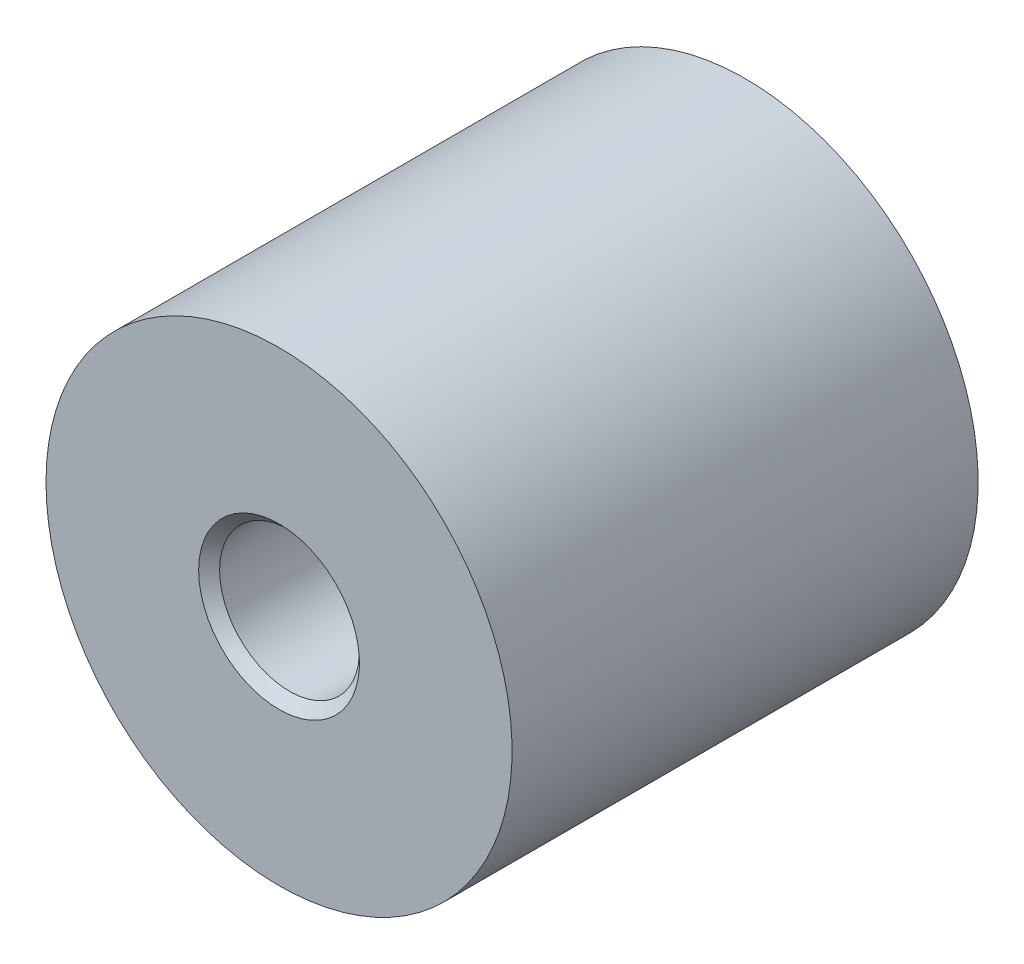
ISO-10303-21;
HEADER;
FILE_DESCRIPTION(('STEP AP214'),'2;1');
FILE_NAME('part.step','',(''),(''),'','','');
FILE_SCHEMA(('AUTOMOTIVE_DESIGN { 1 0 10303 214 1 1 1 1 }'));
ENDSEC;
DATA;
#1=APPLICATION_CONTEXT('core data for automotive mechanical design processes');
#2=APPLICATION_PROTOCOL_DEFINITION('international standard','automotive_design',2000,#1);
#3=PRODUCT_CONTEXT('',#1,'mechanical');
#4=PRODUCT('Part','Part','',(#3));
#5=PRODUCT_RELATED_PRODUCT_CATEGORY('part','',(#4));
#6=PRODUCT_DEFINITION_FORMATION('','',#4);
#7=PRODUCT_DEFINITION_CONTEXT('part definition',#1,'design');
#8=PRODUCT_DEFINITION('design','',#6,#7);
#9=PRODUCT_DEFINITION_SHAPE('','',#8);
#10=(LENGTH_UNIT() NAMED_UNIT(*) SI_UNIT(.MILLI.,.METRE.));
#11=(NAMED_UNIT(*) PLANE_ANGLE_UNIT() SI_UNIT($,.RADIAN.));
#12=(NAMED_UNIT(*) SI_UNIT($,.STERADIAN.) SOLID_ANGLE_UNIT());
#13=UNCERTAINTY_MEASURE_WITH_UNIT(LENGTH_MEASURE(1.E-05),#10,'distance_accuracy_value','');
#14=(GEOMETRIC_REPRESENTATION_CONTEXT(3) GLOBAL_UNCERTAINTY_ASSIGNED_CONTEXT((#13)) GLOBAL_UNIT_ASSIGNED_CONTEXT((#10,
#11,#12)) REPRESENTATION_CONTEXT('',''));
#15=CARTESIAN_POINT('',(0.,0.,0.));
#16=DIRECTION('',(0.,0.,1.));
#17=DIRECTION('',(1.,0.,0.));
#18=AXIS2_PLACEMENT_3D('',#15,#16,#17);
#19=CARTESIAN_POINT('',(0.,0.,0.));
#20=DIRECTION('',(0.,0.,-1.));
#21=DIRECTION('',(-1.,0.,0.));
#22=AXIS2_PLACEMENT_3D('',#19,#20,#21);
#23=CYLINDRICAL_SURFACE('',#22,10.);
#24=CARTESIAN_POINT('',(0.,0.,20.));
#25=DIRECTION('',(0.,0.,-1.));
#26=DIRECTION('',(-1.,0.,0.));
#27=AXIS2_PLACEMENT_3D('',#24,#25,#26);
#28=CIRCLE('',#27,10.);
#29=CARTESIAN_POINT('',(-10.,0.,20.));
#30=VERTEX_POINT('',#29);
#31=EDGE_CURVE('E19',#30,#30,#28,.T.);
#32=ORIENTED_EDGE('',*,*,#31,.T.);
#33=EDGE_LOOP('',(#32));
#34=FACE_BOUND('',#33,.T.);
#35=CARTESIAN_POINT('',(0.,0.,0.));
#36=DIRECTION('',(0.,0.,-1.));
#37=DIRECTION('',(-1.,0.,0.));
#38=AXIS2_PLACEMENT_3D('',#35,#36,#37);
#39=CIRCLE('',#38,10.);
#40=CARTESIAN_POINT('',(-10.,0.,0.));
#41=VERTEX_POINT('',#40);
#42=EDGE_CURVE('E8',#41,#41,#39,.T.);
#43=ORIENTED_EDGE('',*,*,#42,.F.);
#44=EDGE_LOOP('',(#43));
#45=FACE_BOUND('',#44,.T.);
#46=ADVANCED_FACE('F12',(#34,#45),#23,.T.);
#47=CARTESIAN_POINT('',(0.,10.,20.));
#48=DIRECTION('',(0.,0.,1.));
#49=DIRECTION('',(1.,0.,0.));
#50=AXIS2_PLACEMENT_3D('',#47,#48,#49);
#51=PLANE('',#50);
#52=CARTESIAN_POINT('',(0.,0.,20.));
#53=DIRECTION('',(0.,0.,-1.));
#54=DIRECTION('',(-1.,0.,0.));
#55=AXIS2_PLACEMENT_3D('',#52,#53,#54);
#56=CIRCLE('',#55,3.45);
#57=CARTESIAN_POINT('',(-3.45,0.,20.));
#58=VERTEX_POINT('',#57);
#59=EDGE_CURVE('E23',#58,#58,#56,.T.);
#60=ORIENTED_EDGE('',*,*,#59,.T.);
#61=EDGE_LOOP('',(#60));
#62=FACE_BOUND('',#61,.T.);
#63=ORIENTED_EDGE('',*,*,#31,.F.);
#64=EDGE_LOOP('',(#63));
#65=FACE_BOUND('',#64,.T.);
#66=ADVANCED_FACE('F48',(#62,#65),#51,.T.);
#67=CARTESIAN_POINT('',(0.,0.,20.));
#68=DIRECTION('',(0.,0.,1.));
#69=DIRECTION('',(1.,0.,0.));
#70=AXIS2_PLACEMENT_3D('',#67,#68,#69);
#71=CONICAL_SURFACE('',#70,3.45,0.785398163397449);
#72=CARTESIAN_POINT('',(0.,0.,19.55));
#73=DIRECTION('',(0.,0.,-1.));
#74=DIRECTION('',(-1.,0.,0.));
#75=AXIS2_PLACEMENT_3D('',#72,#73,#74);
#76=CIRCLE('',#75,3.);
#77=CARTESIAN_POINT('',(-3.,0.,19.55));
#78=VERTEX_POINT('',#77);
#79=EDGE_CURVE('E27',#78,#78,#76,.T.);
#80=ORIENTED_EDGE('',*,*,#79,.T.);
#81=EDGE_LOOP('',(#80));
#82=FACE_BOUND('',#81,.T.);
#83=ORIENTED_EDGE('',*,*,#59,.F.);
#84=EDGE_LOOP('',(#83));
#85=FACE_BOUND('',#84,.T.);
#86=ADVANCED_FACE('F40',(#82,#85),#71,.F.);
#87=CARTESIAN_POINT('',(0.,0.,0.));
#88=DIRECTION('',(0.,0.,-1.));
#89=DIRECTION('',(-1.,0.,0.));
#90=AXIS2_PLACEMENT_3D('',#87,#88,#89);
#91=CYLINDRICAL_SURFACE('',#90,3.);
#92=ORIENTED_EDGE('',*,*,#79,.F.);
#93=EDGE_LOOP('',(#92));
#94=FACE_BOUND('',#93,.T.);
#95=CARTESIAN_POINT('',(0.,0.,14.));
#96=DIRECTION('',(0.,0.,1.));
#97=DIRECTION('',(1.,0.,0.));
#98=AXIS2_PLACEMENT_3D('',#95,#96,#97);
#99=CIRCLE('',#98,3.);
#100=CARTESIAN_POINT('',(3.,0.,14.));
#101=VERTEX_POINT('',#100);
#102=EDGE_CURVE('E32',#101,#101,#99,.T.);
#103=ORIENTED_EDGE('',*,*,#102,.F.);
#104=EDGE_LOOP('',(#103));
#105=FACE_BOUND('',#104,.T.);
#106=ADVANCED_FACE('F38',(#94,#105),#91,.F.);
#107=CARTESIAN_POINT('',(7.5,0.,0.));
#108=DIRECTION('',(0.,0.,-1.));
#109=DIRECTION('',(0.,1.,0.));
#110=AXIS2_PLACEMENT_3D('',#107,#108,#109);
#111=PLANE('',#110);
#112=ORIENTED_EDGE('',*,*,#42,.T.);
#113=EDGE_LOOP('',(#112));
#114=FACE_BOUND('',#113,.T.);
#115=ADVANCED_FACE('F14',(#114),#111,.T.);
#116=CARTESIAN_POINT('',(0.,0.,14.));
#117=DIRECTION('',(0.,0.,1.));
#118=DIRECTION('',(1.,0.,0.));
#119=AXIS2_PLACEMENT_3D('',#116,#117,#118);
#120=PLANE('',#119);
#121=ORIENTED_EDGE('',*,*,#102,.T.);
#122=EDGE_LOOP('',(#121));
#123=FACE_BOUND('',#122,.T.);
#124=ADVANCED_FACE('F36',(#123),#120,.T.);
#125=CLOSED_SHELL('',(#46,#66,#86,#106,#115,#124));
#126=MANIFOLD_SOLID_BREP('B1',#125);
#127=ADVANCED_BREP_SHAPE_REPRESENTATION('',(#18,#126),#14);
#128=SHAPE_DEFINITION_REPRESENTATION(#9,#127);
ENDSEC;
END-ISO-10303-21;
